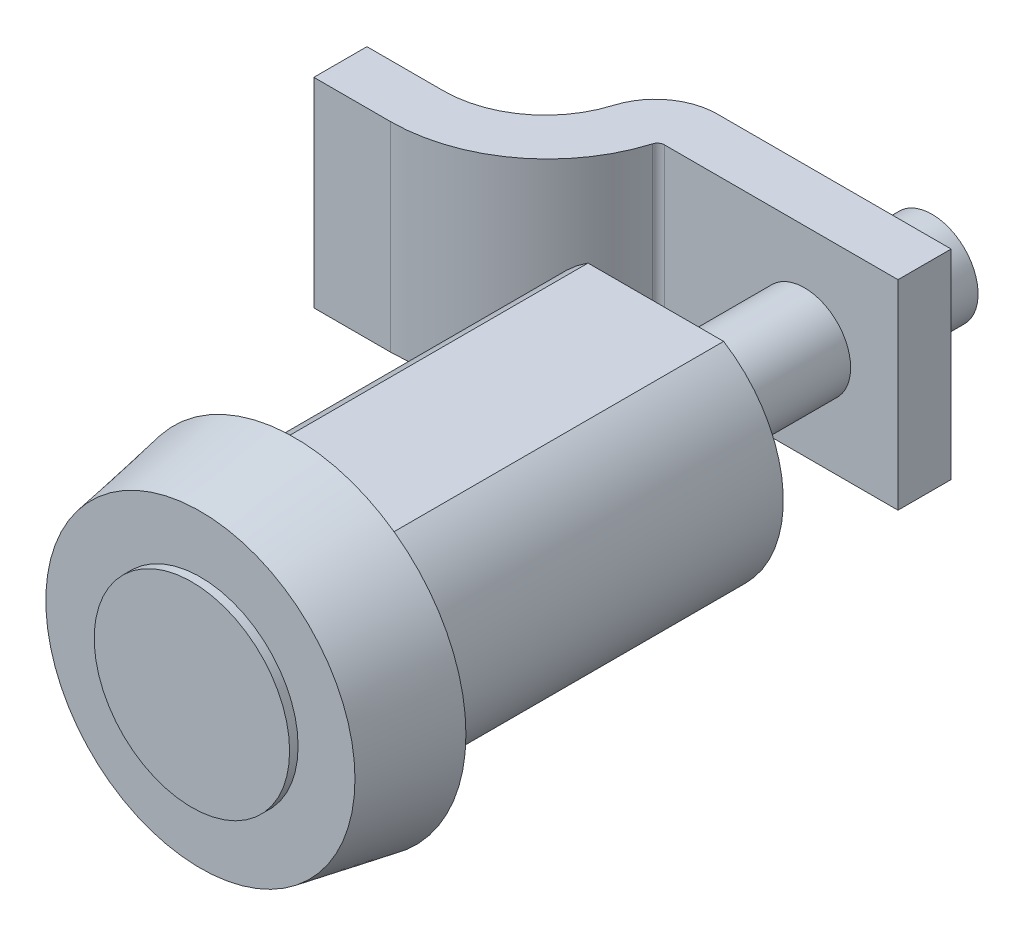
from build123d import *

# Parameters (mm, degrees)
SKETCH1_R                = 10.2362
BOSS_EXTRUDE1_DEPTH      = 5.6388
DRAFT1_ANGLE             = -10
SKETCH2_R                = 5.842
BOSS_EXTRUDE2_DEPTH      = 0.508
BOSS_EXTRUDE3_DEPTH      = 21.59
SKETCH4_R                = 2.7559
BOSS_EXTRUDE4_DEPTH      = 16.51
BOSS_EXTRUDE5_DEPTH      = 5.969
BOSS_EXTRUDE5_DEPTH_BACK = 5.969


with BuildPart() as part:
    # Sketch1 → Boss-Extrude1 (new body)
    with BuildSketch(Plane.XY):
        Circle(SKETCH1_R)
    extrude(amount=BOSS_EXTRUDE1_DEPTH)

    # Draft1
    draft1_faces = [part.faces().sort_by_distance(p)[0] for p in [
        (-10.2362, 0, 2.8194),
    ]]
    draft(draft1_faces, Plane(origin=(0, 0, 0), x_dir=(-1, 0, 0), z_dir=(0, 0, -1)), DRAFT1_ANGLE)

    # Sketch2 → Boss-Extrude2 (add)
    with BuildSketch(Plane.XY.offset(5.6388)):
        Circle(SKETCH2_R)
    extrude(amount=BOSS_EXTRUDE2_DEPTH)

    # Sketch3 → Boss-Extrude3 (add)
    with BuildSketch(Plane(origin=(0, 0, 0), x_dir=(-1, 0, 0), z_dir=(0, 0, -1))):
        with BuildLine():
            Line((-4.054782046, 6.4516), (4.054782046, 6.4516))
            ThreePointArc((4.054782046, 6.4516), (7.62, 0), (4.054782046, -6.4516))
            Line((4.054782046, -6.4516), (-4.054782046, -6.4516))
            ThreePointArc((-4.054782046, -6.4516), (-7.62, 0), (-4.054782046, 6.4516))
        make_face()
    extrude(amount=BOSS_EXTRUDE3_DEPTH)

    # Sketch4 → Boss-Extrude4 (add)
    with BuildSketch(Plane(origin=(0, 0, -21.59), x_dir=(-1, 0, 0), z_dir=(0, 0, -1))):
        Circle(SKETCH4_R)
    extrude(amount=BOSS_EXTRUDE4_DEPTH)

    # Sketch6 → Boss-Extrude5 (add, two sides: drawn at the far end of the back side and taken through both)
    with BuildSketch(Plane(origin=(0, 0, 0), x_dir=(1, 0, 0), z_dir=(0, 1, 0)).offset(-BOSS_EXTRUDE5_DEPTH_BACK)):
        with BuildLine():
            Line((5.588, 33.655), (5.588, 30.48))
            Line((5.588, 30.48), (-8.382, 30.48))
            ThreePointArc((-8.382, 30.48), (-8.630625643, 30.397723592), (-8.781091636, 30.183377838))
            ThreePointArc((-8.781091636, 30.183377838), (-12.173870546, 25.350207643), (-17.78, 23.495))
            Line((-17.78, 23.495), (-22.352, 23.495))
            Line((-22.352, 23.495), (-22.352, 26.67))
            Line((-22.352, 26.67), (-17.78, 26.67))
            ThreePointArc((-17.78, 26.67), (-14.143591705, 27.873377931), (-11.942870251, 31.008407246))
            ThreePointArc((-11.942870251, 31.008407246), (-10.600346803, 32.92089388), (-8.382, 33.655))
            Line((-8.382, 33.655), (5.588, 33.655))
        make_face()
    extrude(amount=BOSS_EXTRUDE5_DEPTH + BOSS_EXTRUDE5_DEPTH_BACK)


solid = part.part
